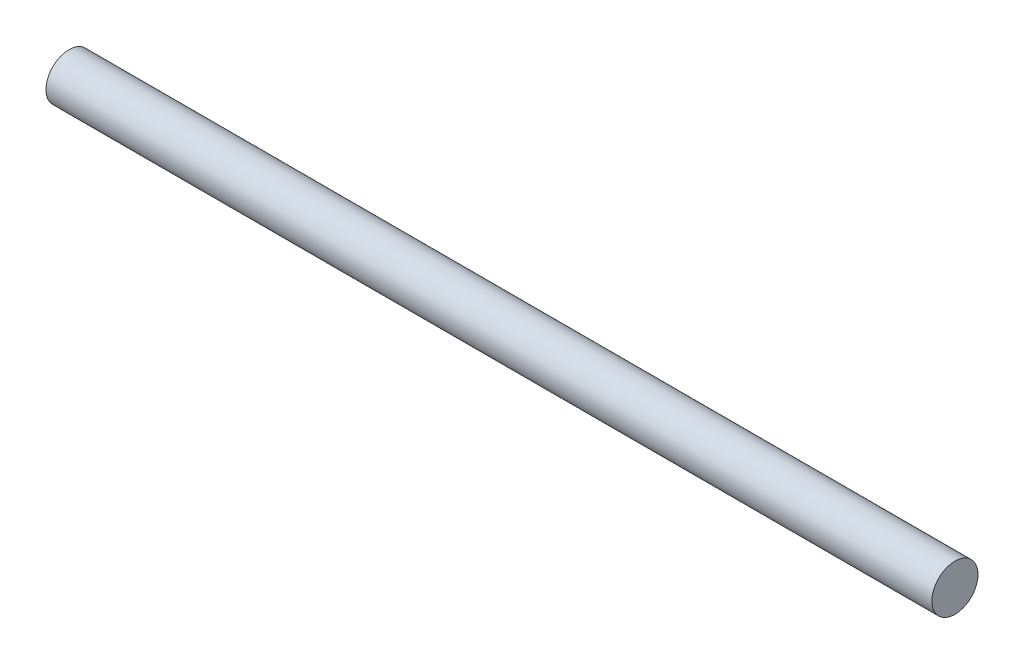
from build123d import *

# Parameters (mm, degrees)
SKETCH1_R           = 2.5
BOSS_EXTRUDE1_DEPTH = 48


with BuildPart() as part:
    # Sketch1 → Boss-Extrude1 (new, symmetric)
    with BuildSketch(Plane(origin=(0, 0, 0), x_dir=(0, 0, -1), z_dir=(1, 0, 0))):
        Circle(SKETCH1_R)
    extrude(amount=BOSS_EXTRUDE1_DEPTH, both=True)


solid = part.part
